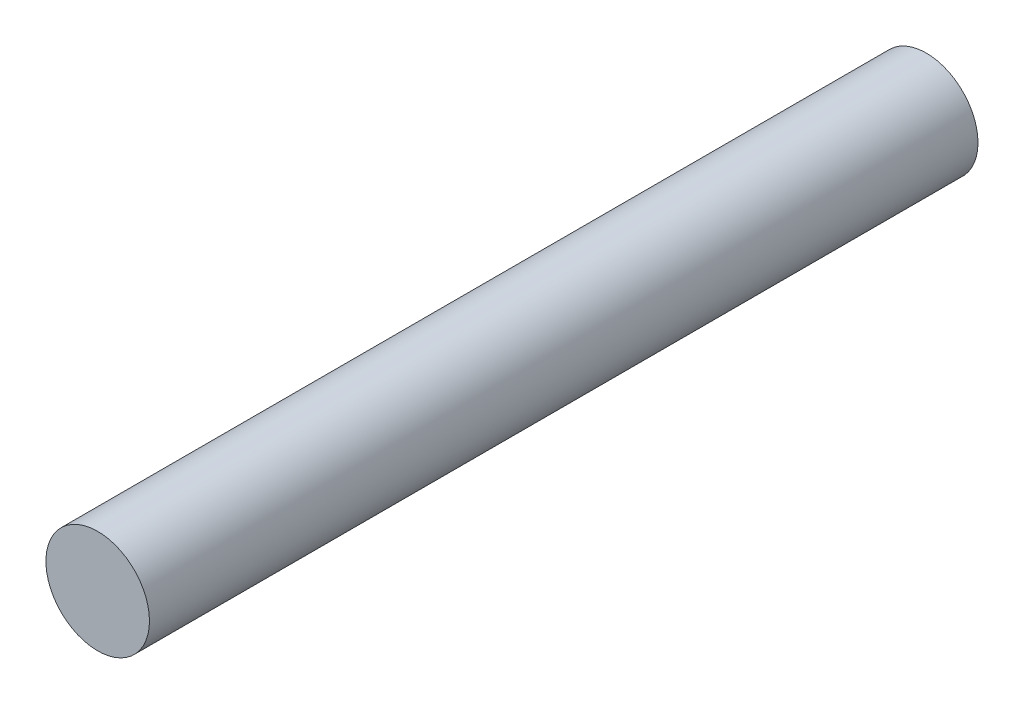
from build123d import *

# Parameters (mm, degrees)
BOSS_EXTRUDE1_DEPTH      = 12
BOSS_EXTRUDE1_DEPTH_BACK = 12
SKETCH1_R                = 1.5


with BuildPart() as part:
    # Sketch1 → Boss-Extrude1 (new, two sides: drawn at the far end of the back side and taken through both)
    with BuildSketch(Plane.XY.offset(-BOSS_EXTRUDE1_DEPTH_BACK)):
        Circle(SKETCH1_R)
    extrude(amount=BOSS_EXTRUDE1_DEPTH + BOSS_EXTRUDE1_DEPTH_BACK)


solid = part.part
